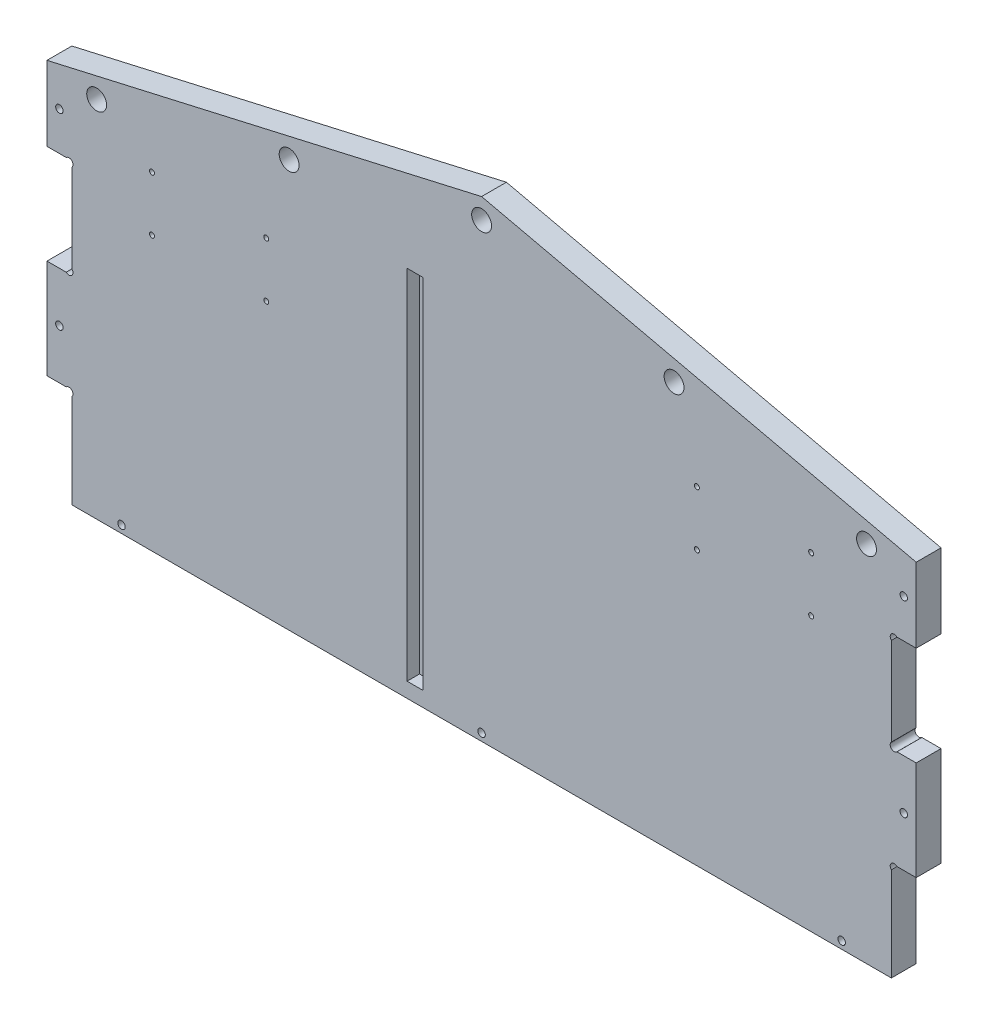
from build123d import *

# Parameters (mm, degrees)
EXTRUSION1_DEPTH                             = 10
ESQUISSE4_R                                  = 1.6
ENL_V_MAT_EXTRU_1_ENFOURCHEMENT_DEPTH        = 399.371685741
ESQUISSE5_R                                  = 1.5
ENL_V_MAT_EXTRU_2_FIXATION_SOL_ET_MURS_DEPTH = 399.371685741
ESQUISSE6_R                                  = 4
ENL_V_MAT_EXTRU_3_FIXATION_CABLES_DEPTH      = 399.371685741
ESQUISSE9_W                                  = 6.5
ESQUISSE9_H                                  = 144
ENL_V_MAT_EXTRU_1_DEPTH                      = 5
ESQUISSE8_R                                  = 1
ENL_V_MAT_EXTRU_2_DEPTH                      = 399.371685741
ESQUISSE10_R                                 = 1.5
ENL_V_MAT_EXTRU_3_DEPTH                      = 399.277541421


with BuildPart() as part:
    # Esquisse1 → Extrusion1 (new body)
    with BuildSketch(Plane.XY):
        Polygon((0, 40), (10, 40), (10, 0), (340, 0), (340, 40), (350, 40), (350, 80), (340, 80), (340, 120), (350, 120), (350, 150), (175, 190), (0, 150), (0, 120), (10, 120), (10, 80), (0, 80), align=None)
    extrude(amount=EXTRUSION1_DEPTH)

    # Esquisse4 → Enl_v. mat.-Extru.1_enfourchement (cut, through all)
    with BuildSketch(Plane.XY.offset(10)):
        with Locations((8.86862915, 118.86862915)):
            Circle(ESQUISSE4_R)
        with Locations((8.86862915, 81.13137085)):
            Circle(ESQUISSE4_R)
        with Locations((8.86862915, 38.86862915)):
            Circle(ESQUISSE4_R)
        with Locations((341.13137085, 118.86862915)):
            Circle(ESQUISSE4_R)
        with Locations((341.13137085, 81.13137085)):
            Circle(ESQUISSE4_R)
        with Locations((341.13137085, 38.86862915)):
            Circle(ESQUISSE4_R)
    extrude(amount=-ENL_V_MAT_EXTRU_1_ENFOURCHEMENT_DEPTH, mode=Mode.SUBTRACT)

    # Esquisse5 → Enl_v. mat.-Extru.2_fixation sol et murs (cut, through all)
    with BuildSketch(Plane.XY.offset(10)):
        with Locations((30, 3)):
            Circle(ESQUISSE5_R)
        with Locations((175, 3)):
            Circle(ESQUISSE5_R)
        with Locations((320, 3)):
            Circle(ESQUISSE5_R)
        with Locations((5, 135.571428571)):
            Circle(ESQUISSE5_R)
        with Locations((345, 135.571428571)):
            Circle(ESQUISSE5_R)
        with Locations((5, 60)):
            Circle(ESQUISSE5_R)
        with Locations((345, 60)):
            Circle(ESQUISSE5_R)
    extrude(amount=-ENL_V_MAT_EXTRU_2_FIXATION_SOL_ET_MURS_DEPTH, mode=Mode.SUBTRACT)

    # Esquisse6 → Enl_v. mat.-Extru.3_fixation cables (cut, through all)
    with BuildSketch(Plane.XY.offset(10)):
        with Locations((175, 181.793680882)):
            Circle(ESQUISSE6_R)
        with Locations((330, 146.365109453)):
            Circle(ESQUISSE6_R)
        with Locations((20, 146.365109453)):
            Circle(ESQUISSE6_R)
        with Locations((252.501251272, 164.079109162)):
            Circle(ESQUISSE6_R)
        with Locations((97.498748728, 164.079109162)):
            Circle(ESQUISSE6_R)
    extrude(amount=-ENL_V_MAT_EXTRU_3_FIXATION_CABLES_DEPTH, mode=Mode.SUBTRACT)

    # Esquisse9 → Enl_v. mat.-Extru.1 (cut)
    with BuildSketch(Plane.XY.offset(10)):
        with Locations((148.25, 78)):
            Rectangle(ESQUISSE9_W, ESQUISSE9_H)
    extrude(amount=-ENL_V_MAT_EXTRU_1_DEPTH, mode=Mode.SUBTRACT)

    # Esquisse8 → Enl_v. mat.-Extru.2 (cut, through all)
    with BuildSketch(Plane.XY.offset(10)):
        with Locations((261.702553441, 132.177640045)):
            Circle(ESQUISSE8_R)
        with Locations((261.702553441, 110.177640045)):
            Circle(ESQUISSE8_R)
        with Locations((88.297446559, 110.177640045)):
            Circle(ESQUISSE8_R)
        with Locations((88.297446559, 132.177640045)):
            Circle(ESQUISSE8_R)
        with Locations((42.297446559, 132.177640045)):
            Circle(ESQUISSE8_R)
        with Locations((42.297446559, 110.177640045)):
            Circle(ESQUISSE8_R)
        with Locations((307.702553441, 132.177640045)):
            Circle(ESQUISSE8_R)
        with Locations((307.702553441, 110.177640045)):
            Circle(ESQUISSE8_R)
    extrude(amount=-ENL_V_MAT_EXTRU_2_DEPTH, mode=Mode.SUBTRACT)

    # Esquisse10 → Enl_v. mat.-Extru.3 (cut, through all)
    with BuildSketch(Plane.XY.offset(5)):
        with Locations((148.25, 140)):
            Circle(ESQUISSE10_R)
        with Locations((148.25, 78)):
            Circle(ESQUISSE10_R)
        with Locations((148.25, 15)):
            Circle(ESQUISSE10_R)
    extrude(amount=-ENL_V_MAT_EXTRU_3_DEPTH, mode=Mode.SUBTRACT)


solid = part.part
